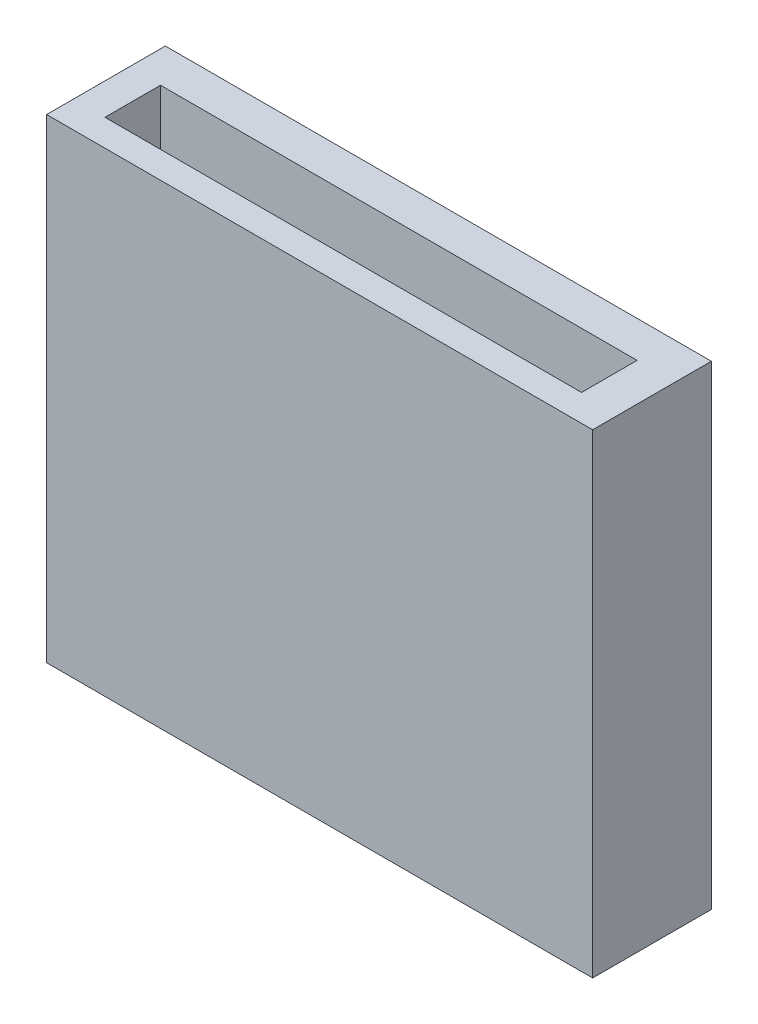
ISO-10303-21;
HEADER;
FILE_DESCRIPTION(('STEP AP214'),'2;1');
FILE_NAME('part.step','',(''),(''),'','','');
FILE_SCHEMA(('AUTOMOTIVE_DESIGN { 1 0 10303 214 1 1 1 1 }'));
ENDSEC;
DATA;
#1=APPLICATION_CONTEXT('core data for automotive mechanical design processes');
#2=APPLICATION_PROTOCOL_DEFINITION('international standard','automotive_design',2000,#1);
#3=PRODUCT_CONTEXT('',#1,'mechanical');
#4=PRODUCT('Part','Part','',(#3));
#5=PRODUCT_RELATED_PRODUCT_CATEGORY('part','',(#4));
#6=PRODUCT_DEFINITION_FORMATION('','',#4);
#7=PRODUCT_DEFINITION_CONTEXT('part definition',#1,'design');
#8=PRODUCT_DEFINITION('design','',#6,#7);
#9=PRODUCT_DEFINITION_SHAPE('','',#8);
#10=(LENGTH_UNIT() NAMED_UNIT(*) SI_UNIT(.MILLI.,.METRE.));
#11=(NAMED_UNIT(*) PLANE_ANGLE_UNIT() SI_UNIT($,.RADIAN.));
#12=(NAMED_UNIT(*) SI_UNIT($,.STERADIAN.) SOLID_ANGLE_UNIT());
#13=UNCERTAINTY_MEASURE_WITH_UNIT(LENGTH_MEASURE(1.E-05),#10,'distance_accuracy_value','');
#14=(GEOMETRIC_REPRESENTATION_CONTEXT(3) GLOBAL_UNCERTAINTY_ASSIGNED_CONTEXT((#13)) GLOBAL_UNIT_ASSIGNED_CONTEXT((#10,
#11,#12)) REPRESENTATION_CONTEXT('',''));
#15=CARTESIAN_POINT('',(0.,0.,0.));
#16=DIRECTION('',(0.,0.,1.));
#17=DIRECTION('',(1.,0.,0.));
#18=AXIS2_PLACEMENT_3D('',#15,#16,#17);
#19=CARTESIAN_POINT('',(0.,40.,0.));
#20=DIRECTION('',(1.,0.,0.));
#21=DIRECTION('',(0.,0.,-1.));
#22=AXIS2_PLACEMENT_3D('',#19,#20,#21);
#23=PLANE('',#22);
#24=DIRECTION('',(0.,0.,1.));
#25=VECTOR('',#24,1.);
#26=CARTESIAN_POINT('',(0.,0.,0.));
#27=LINE('',#26,#25);
#28=CARTESIAN_POINT('',(0.,0.,-10.));
#29=VERTEX_POINT('',#28);
#30=CARTESIAN_POINT('',(0.,0.,0.));
#31=VERTEX_POINT('',#30);
#32=EDGE_CURVE('E154',#29,#31,#27,.T.);
#33=ORIENTED_EDGE('',*,*,#32,.T.);
#34=DIRECTION('',(0.,-1.,0.));
#35=VECTOR('',#34,1.);
#36=CARTESIAN_POINT('',(0.,40.,0.));
#37=LINE('',#36,#35);
#38=CARTESIAN_POINT('',(0.,40.,0.));
#39=VERTEX_POINT('',#38);
#40=EDGE_CURVE('E11',#39,#31,#37,.T.);
#41=ORIENTED_EDGE('',*,*,#40,.F.);
#42=DIRECTION('',(0.,0.,1.));
#43=VECTOR('',#42,1.);
#44=CARTESIAN_POINT('',(0.,40.,0.));
#45=LINE('',#44,#43);
#46=CARTESIAN_POINT('',(0.,40.,-10.));
#47=VERTEX_POINT('',#46);
#48=EDGE_CURVE('E155',#47,#39,#45,.T.);
#49=ORIENTED_EDGE('',*,*,#48,.F.);
#50=DIRECTION('',(0.,-1.,0.));
#51=VECTOR('',#50,1.);
#52=CARTESIAN_POINT('',(0.,40.,-10.));
#53=LINE('',#52,#51);
#54=EDGE_CURVE('E169',#47,#29,#53,.T.);
#55=ORIENTED_EDGE('',*,*,#54,.T.);
#56=EDGE_LOOP('',(#33,#41,#49,#55));
#57=FACE_BOUND('',#56,.T.);
#58=ADVANCED_FACE('F43',(#57),#23,.F.);
#59=CARTESIAN_POINT('',(0.,40.,0.));
#60=DIRECTION('',(0.,0.,-1.));
#61=DIRECTION('',(-1.,0.,0.));
#62=AXIS2_PLACEMENT_3D('',#59,#60,#61);
#63=PLANE('',#62);
#64=DIRECTION('',(1.,0.,0.));
#65=VECTOR('',#64,1.);
#66=CARTESIAN_POINT('',(0.,0.,0.));
#67=LINE('',#66,#65);
#68=CARTESIAN_POINT('',(46.,0.,0.));
#69=VERTEX_POINT('',#68);
#70=EDGE_CURVE('E173',#31,#69,#67,.T.);
#71=ORIENTED_EDGE('',*,*,#70,.T.);
#72=DIRECTION('',(0.,-1.,0.));
#73=VECTOR('',#72,1.);
#74=CARTESIAN_POINT('',(46.,40.,0.));
#75=LINE('',#74,#73);
#76=CARTESIAN_POINT('',(46.,40.,0.));
#77=VERTEX_POINT('',#76);
#78=EDGE_CURVE('E51',#77,#69,#75,.T.);
#79=ORIENTED_EDGE('',*,*,#78,.F.);
#80=DIRECTION('',(1.,0.,0.));
#81=VECTOR('',#80,1.);
#82=CARTESIAN_POINT('',(0.,40.,0.));
#83=LINE('',#82,#81);
#84=EDGE_CURVE('E159',#39,#77,#83,.T.);
#85=ORIENTED_EDGE('',*,*,#84,.F.);
#86=ORIENTED_EDGE('',*,*,#40,.T.);
#87=EDGE_LOOP('',(#71,#79,#85,#86));
#88=FACE_BOUND('',#87,.T.);
#89=ADVANCED_FACE('F207',(#88),#63,.F.);
#90=CARTESIAN_POINT('',(46.,40.,0.));
#91=DIRECTION('',(-1.,0.,0.));
#92=DIRECTION('',(0.,0.,1.));
#93=AXIS2_PLACEMENT_3D('',#90,#91,#92);
#94=PLANE('',#93);
#95=DIRECTION('',(0.,0.,-1.));
#96=VECTOR('',#95,1.);
#97=CARTESIAN_POINT('',(46.,0.,0.));
#98=LINE('',#97,#96);
#99=CARTESIAN_POINT('',(46.,0.,-10.));
#100=VERTEX_POINT('',#99);
#101=EDGE_CURVE('E176',#69,#100,#98,.T.);
#102=ORIENTED_EDGE('',*,*,#101,.T.);
#103=DIRECTION('',(0.,-1.,0.));
#104=VECTOR('',#103,1.);
#105=CARTESIAN_POINT('',(46.,40.,-10.));
#106=LINE('',#105,#104);
#107=CARTESIAN_POINT('',(46.,40.,-10.));
#108=VERTEX_POINT('',#107);
#109=EDGE_CURVE('E184',#108,#100,#106,.T.);
#110=ORIENTED_EDGE('',*,*,#109,.F.);
#111=DIRECTION('',(0.,0.,-1.));
#112=VECTOR('',#111,1.);
#113=CARTESIAN_POINT('',(46.,40.,0.));
#114=LINE('',#113,#112);
#115=EDGE_CURVE('E163',#77,#108,#114,.T.);
#116=ORIENTED_EDGE('',*,*,#115,.F.);
#117=ORIENTED_EDGE('',*,*,#78,.T.);
#118=EDGE_LOOP('',(#102,#110,#116,#117));
#119=FACE_BOUND('',#118,.T.);
#120=ADVANCED_FACE('F193',(#119),#94,.F.);
#121=CARTESIAN_POINT('',(0.,40.,-10.));
#122=DIRECTION('',(0.,0.,1.));
#123=DIRECTION('',(1.,0.,0.));
#124=AXIS2_PLACEMENT_3D('',#121,#122,#123);
#125=PLANE('',#124);
#126=DIRECTION('',(-1.,0.,0.));
#127=VECTOR('',#126,1.);
#128=CARTESIAN_POINT('',(0.,0.,-10.));
#129=LINE('',#128,#127);
#130=EDGE_CURVE('E160',#100,#29,#129,.T.);
#131=ORIENTED_EDGE('',*,*,#130,.T.);
#132=ORIENTED_EDGE('',*,*,#54,.F.);
#133=DIRECTION('',(-1.,0.,0.));
#134=VECTOR('',#133,1.);
#135=CARTESIAN_POINT('',(0.,40.,-10.));
#136=LINE('',#135,#134);
#137=EDGE_CURVE('E166',#108,#47,#136,.T.);
#138=ORIENTED_EDGE('',*,*,#137,.F.);
#139=ORIENTED_EDGE('',*,*,#109,.T.);
#140=EDGE_LOOP('',(#131,#132,#138,#139));
#141=FACE_BOUND('',#140,.T.);
#142=ADVANCED_FACE('F200',(#141),#125,.F.);
#143=CARTESIAN_POINT('',(0.,40.,0.));
#144=DIRECTION('',(0.,-1.,0.));
#145=DIRECTION('',(0.,0.,-1.));
#146=AXIS2_PLACEMENT_3D('',#143,#144,#145);
#147=PLANE('',#146);
#148=DIRECTION('',(0.,0.,1.));
#149=VECTOR('',#148,1.);
#150=CARTESIAN_POINT('',(2.65742940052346,40.,-2.25462943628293));
#151=LINE('',#150,#149);
#152=CARTESIAN_POINT('',(2.65742940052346,40.,-6.93462943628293));
#153=VERTEX_POINT('',#152);
#154=CARTESIAN_POINT('',(2.65742940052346,40.,-2.25462943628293));
#155=VERTEX_POINT('',#154);
#156=EDGE_CURVE('E136',#153,#155,#151,.T.);
#157=ORIENTED_EDGE('',*,*,#156,.F.);
#158=DIRECTION('',(-1.,0.,0.));
#159=VECTOR('',#158,1.);
#160=CARTESIAN_POINT('',(2.65742940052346,40.,-6.93462943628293));
#161=LINE('',#160,#159);
#162=CARTESIAN_POINT('',(42.8074294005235,40.,-6.93462943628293));
#163=VERTEX_POINT('',#162);
#164=EDGE_CURVE('E126',#163,#153,#161,.T.);
#165=ORIENTED_EDGE('',*,*,#164,.F.);
#166=DIRECTION('',(0.,0.,-1.));
#167=VECTOR('',#166,1.);
#168=CARTESIAN_POINT('',(42.8074294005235,40.,-2.25462943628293));
#169=LINE('',#168,#167);
#170=CARTESIAN_POINT('',(42.8074294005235,40.,-2.25462943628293));
#171=VERTEX_POINT('',#170);
#172=EDGE_CURVE('E140',#171,#163,#169,.T.);
#173=ORIENTED_EDGE('',*,*,#172,.F.);
#174=DIRECTION('',(1.,0.,0.));
#175=VECTOR('',#174,1.);
#176=CARTESIAN_POINT('',(2.65742940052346,40.,-2.25462943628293));
#177=LINE('',#176,#175);
#178=EDGE_CURVE('E58',#155,#171,#177,.T.);
#179=ORIENTED_EDGE('',*,*,#178,.F.);
#180=EDGE_LOOP('',(#157,#165,#173,#179));
#181=FACE_BOUND('',#180,.T.);
#182=ORIENTED_EDGE('',*,*,#48,.T.);
#183=ORIENTED_EDGE('',*,*,#84,.T.);
#184=ORIENTED_EDGE('',*,*,#115,.T.);
#185=ORIENTED_EDGE('',*,*,#137,.T.);
#186=EDGE_LOOP('',(#182,#183,#184,#185));
#187=FACE_BOUND('',#186,.T.);
#188=ADVANCED_FACE('F206',(#181,#187),#147,.F.);
#189=CARTESIAN_POINT('',(0.,0.,0.));
#190=DIRECTION('',(0.,-1.,0.));
#191=DIRECTION('',(0.,0.,-1.));
#192=AXIS2_PLACEMENT_3D('',#189,#190,#191);
#193=PLANE('',#192);
#194=DIRECTION('',(-1.,0.,0.));
#195=VECTOR('',#194,1.);
#196=CARTESIAN_POINT('',(2.65742940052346,0.,-6.93462943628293));
#197=LINE('',#196,#195);
#198=CARTESIAN_POINT('',(42.8074294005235,0.,-6.93462943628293));
#199=VERTEX_POINT('',#198);
#200=CARTESIAN_POINT('',(2.65742940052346,0.,-6.93462943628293));
#201=VERTEX_POINT('',#200);
#202=EDGE_CURVE('E123',#199,#201,#197,.T.);
#203=ORIENTED_EDGE('',*,*,#202,.T.);
#204=DIRECTION('',(0.,0.,1.));
#205=VECTOR('',#204,1.);
#206=CARTESIAN_POINT('',(2.65742940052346,0.,-2.25462943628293));
#207=LINE('',#206,#205);
#208=CARTESIAN_POINT('',(2.65742940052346,0.,-2.25462943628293));
#209=VERTEX_POINT('',#208);
#210=EDGE_CURVE('E109',#201,#209,#207,.T.);
#211=ORIENTED_EDGE('',*,*,#210,.T.);
#212=DIRECTION('',(1.,0.,0.));
#213=VECTOR('',#212,1.);
#214=CARTESIAN_POINT('',(2.65742940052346,0.,-2.25462943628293));
#215=LINE('',#214,#213);
#216=CARTESIAN_POINT('',(42.8074294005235,0.,-2.25462943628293));
#217=VERTEX_POINT('',#216);
#218=EDGE_CURVE('E145',#209,#217,#215,.T.);
#219=ORIENTED_EDGE('',*,*,#218,.T.);
#220=DIRECTION('',(0.,0.,-1.));
#221=VECTOR('',#220,1.);
#222=CARTESIAN_POINT('',(42.8074294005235,0.,-2.25462943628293));
#223=LINE('',#222,#221);
#224=EDGE_CURVE('E132',#217,#199,#223,.T.);
#225=ORIENTED_EDGE('',*,*,#224,.T.);
#226=EDGE_LOOP('',(#203,#211,#219,#225));
#227=FACE_BOUND('',#226,.T.);
#228=ORIENTED_EDGE('',*,*,#32,.F.);
#229=ORIENTED_EDGE('',*,*,#130,.F.);
#230=ORIENTED_EDGE('',*,*,#101,.F.);
#231=ORIENTED_EDGE('',*,*,#70,.F.);
#232=EDGE_LOOP('',(#228,#229,#230,#231));
#233=FACE_BOUND('',#232,.T.);
#234=ADVANCED_FACE('F130',(#227,#233),#193,.T.);
#235=CARTESIAN_POINT('',(2.65742940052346,-40.4218369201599,-6.93462943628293));
#236=DIRECTION('',(0.,0.,-1.));
#237=DIRECTION('',(-1.,0.,0.));
#238=AXIS2_PLACEMENT_3D('',#235,#236,#237);
#239=PLANE('',#238);
#240=DIRECTION('',(0.,1.,0.));
#241=VECTOR('',#240,1.);
#242=CARTESIAN_POINT('',(42.8074294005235,-40.4218369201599,-6.93462943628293));
#243=LINE('',#242,#241);
#244=EDGE_CURVE('E66',#199,#163,#243,.T.);
#245=ORIENTED_EDGE('',*,*,#244,.T.);
#246=ORIENTED_EDGE('',*,*,#164,.T.);
#247=DIRECTION('',(0.,1.,0.));
#248=VECTOR('',#247,1.);
#249=CARTESIAN_POINT('',(2.65742940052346,-40.4218369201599,-6.93462943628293));
#250=LINE('',#249,#248);
#251=EDGE_CURVE('E113',#201,#153,#250,.T.);
#252=ORIENTED_EDGE('',*,*,#251,.F.);
#253=ORIENTED_EDGE('',*,*,#202,.F.);
#254=EDGE_LOOP('',(#245,#246,#252,#253));
#255=FACE_BOUND('',#254,.T.);
#256=ADVANCED_FACE('F122',(#255),#239,.F.);
#257=CARTESIAN_POINT('',(2.65742940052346,-40.4218369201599,-2.25462943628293));
#258=DIRECTION('',(-1.,0.,0.));
#259=DIRECTION('',(0.,0.,1.));
#260=AXIS2_PLACEMENT_3D('',#257,#258,#259);
#261=PLANE('',#260);
#262=ORIENTED_EDGE('',*,*,#251,.T.);
#263=ORIENTED_EDGE('',*,*,#156,.T.);
#264=DIRECTION('',(0.,1.,0.));
#265=VECTOR('',#264,1.);
#266=CARTESIAN_POINT('',(2.65742940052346,-40.4218369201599,-2.25462943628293));
#267=LINE('',#266,#265);
#268=EDGE_CURVE('E115',#209,#155,#267,.T.);
#269=ORIENTED_EDGE('',*,*,#268,.F.);
#270=ORIENTED_EDGE('',*,*,#210,.F.);
#271=EDGE_LOOP('',(#262,#263,#269,#270));
#272=FACE_BOUND('',#271,.T.);
#273=ADVANCED_FACE('F111',(#272),#261,.F.);
#274=CARTESIAN_POINT('',(2.65742940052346,-40.4218369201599,-2.25462943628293));
#275=DIRECTION('',(0.,0.,1.));
#276=DIRECTION('',(1.,0.,0.));
#277=AXIS2_PLACEMENT_3D('',#274,#275,#276);
#278=PLANE('',#277);
#279=ORIENTED_EDGE('',*,*,#268,.T.);
#280=ORIENTED_EDGE('',*,*,#178,.T.);
#281=DIRECTION('',(0.,1.,0.));
#282=VECTOR('',#281,1.);
#283=CARTESIAN_POINT('',(42.8074294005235,-40.4218369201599,-2.25462943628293));
#284=LINE('',#283,#282);
#285=EDGE_CURVE('E144',#217,#171,#284,.T.);
#286=ORIENTED_EDGE('',*,*,#285,.F.);
#287=ORIENTED_EDGE('',*,*,#218,.F.);
#288=EDGE_LOOP('',(#279,#280,#286,#287));
#289=FACE_BOUND('',#288,.T.);
#290=ADVANCED_FACE('F226',(#289),#278,.F.);
#291=CARTESIAN_POINT('',(42.8074294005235,-40.4218369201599,-2.25462943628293));
#292=DIRECTION('',(1.,0.,0.));
#293=DIRECTION('',(0.,0.,-1.));
#294=AXIS2_PLACEMENT_3D('',#291,#292,#293);
#295=PLANE('',#294);
#296=ORIENTED_EDGE('',*,*,#285,.T.);
#297=ORIENTED_EDGE('',*,*,#172,.T.);
#298=ORIENTED_EDGE('',*,*,#244,.F.);
#299=ORIENTED_EDGE('',*,*,#224,.F.);
#300=EDGE_LOOP('',(#296,#297,#298,#299));
#301=FACE_BOUND('',#300,.T.);
#302=ADVANCED_FACE('F229',(#301),#295,.F.);
#303=CLOSED_SHELL('',(#58,#89,#120,#142,#188,#234,#256,#273,#290,#302));
#304=MANIFOLD_SOLID_BREP('B2',#303);
#305=ADVANCED_BREP_SHAPE_REPRESENTATION('',(#18,#304),#14);
#306=SHAPE_DEFINITION_REPRESENTATION(#9,#305);
ENDSEC;
END-ISO-10303-21;
